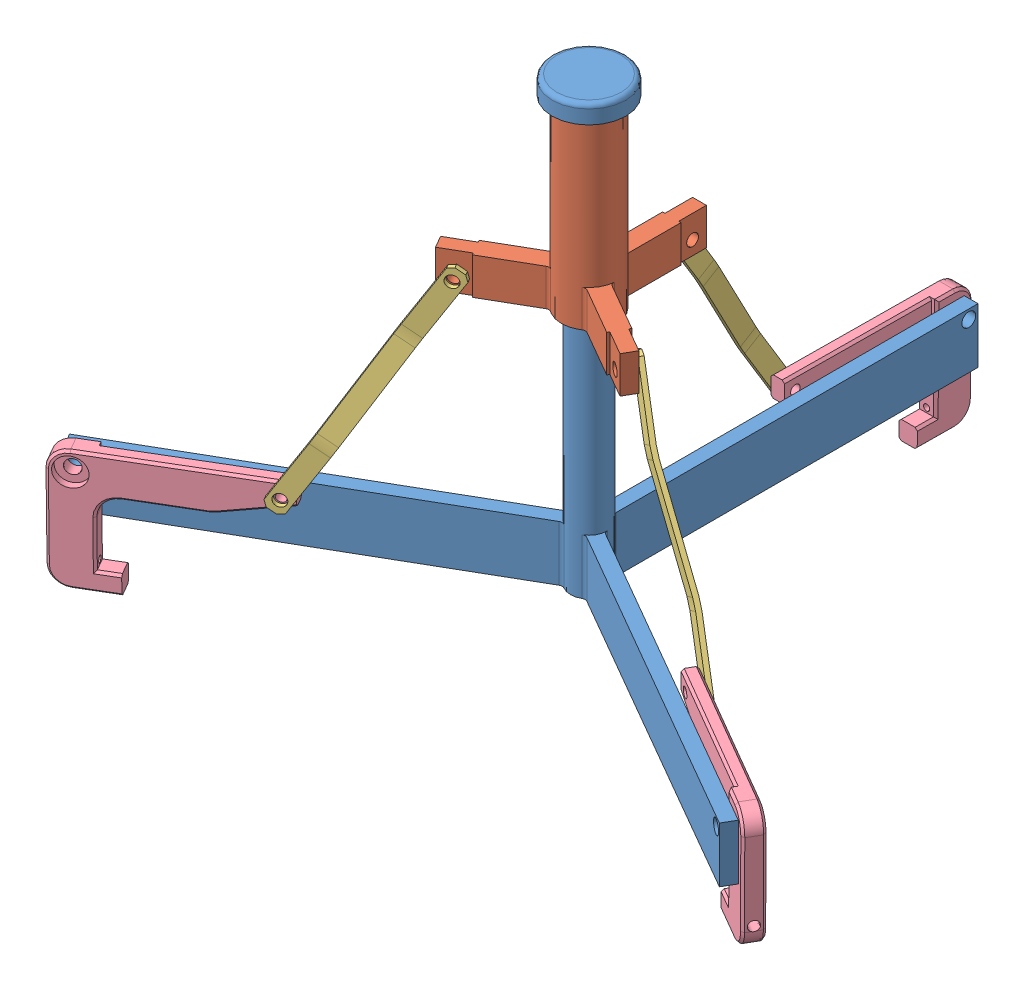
SolidWorks assembly plunger_hook.sldasm, configuration Default (file format 8000). Lengths in mm.
Overall size (473.99 343.02 420.11).
8 component instances, 4 part files, 20 mates.
Components (placement in the parent):
- center-1: center.sldprt [Default] x (-1 0 0) z (0 1 0) size (461.2 399.41 304.8)
- collar-1: collar.sldprt [Default] at (0 165.1 0) x (0.5 0 -0.866025) z (0 1 0) size (136.74 118.42 127)
- con-rod-1: con-rod.sldprt [Default] at (-128.4028 32.9021 97.9635) x (0.449568 0.854704 -0.259558) z (-0.5 0 -0.866025) size (177.8 12.7 14.61)
- con-rod-2: con-rod.sldprt [Default] at (149.0403 32.9021 62.2183) x (-0.449568 0.854704 -0.259558) z (-0.5 0 0.866025) size (177.8 12.7 14.61)
- con-rod-3: con-rod.sldprt [Default] at (-20.6375 32.9021 -160.1818) x (0 0.854704 0.519116) z (1 0 0) size (177.8 12.7 14.61)
- hook-1: hook.sldprt [Default] at (-213.9888 31.75 143.7105) x (-0.865988 -0.009307 0.499978) z (-0.5 0 -0.866025) size (127 82.55 12.7)
- hook-2: hook.sldprt [Default] at (231.4513 31.75 113.4645) x (0.865988 -0.009307 0.499978) z (-0.5 0 0.866025) size (127 82.55 12.7)
- hook-3: hook.sldprt [Default] at (-17.4625 31.75 -257.175) x (0 -0.009307 -0.999957) z (1 0 0) size (127 82.55 12.7)
Mates (geometry in assembly coordinates):
- Coincident1: coincident anti-aligned: plane of center-1 through (0 0 0) normal (0 -1 0); plane of assembly through (0 0 0) normal (0 1 0)
- Coincident2: coincident aligned: plane of center-1; plane of assembly through (0 0 0) normal (0 0 1)
- Coincident3: coincident anti-aligned: plane of center-1; plane of assembly through (0 0 0) normal (1 0 0)
- Concentric1: concentric aligned: cylinder of center-1 through (0 304.8 0) axis (0 -1 0) radius 12.7; cylinder of collar-1 through (0 292.1 0) axis (0 -1 0) radius 12.827
- Concentric2: concentric aligned: cylinder of center-1 through (-106.2292 31.75 330.3557) axis (-0.5 0 -0.866025) radius 4.7625; cylinder of hook-1 through (-213.9888 31.75 143.7105) axis (-0.5 0 -0.866025) radius 4.7625
- Coincident4: coincident anti-aligned: plane of center-1 through (-225.8381 0 135.8869) normal (0.5 0 0.866025); plane of hook-1 through (-231.2345 18.9323 139.0026) normal (-0.5 0 -0.866025)
- Concentric3: concentric aligned: cylinder of con-rod-1 through (-120.0485 36.5527 93.1401) axis (-0.5 0 -0.866025) radius 4.064; cylinder of hook-1 through (-121.636 36.5527 90.3905) axis (-0.5 0 -0.866025) radius 3.302
- Coincident5: coincident anti-aligned: plane of con-rod-1 through (-158.1917 52.6804 111.496) normal (-0.5 0 -0.866025); plane of hook-1 through (-224.8845 18.9323 150.0011) normal (0.5 0 0.866025)
- Concentric4: concentric aligned: cylinder of collar-1 through (-93.1191 174.625 -27.9369) axis (0.5 0 0.866025) radius 4.064; cylinder of con-rod-1 through (-54.726 174.625 38.5618) axis (0.5 0 0.866025) radius 4.064
- Concentric5: concentric aligned: cylinder of hook-2 through (139.0985 36.5527 60.1446) axis (-0.5 0 0.866025) radius 3.302; cylinder of con-rod-2 through (140.686 36.5527 57.3949) axis (-0.5 0 0.866025) radius 4.064
- Coincident6: coincident anti-aligned: plane of hook-2 through (242.347 18.9323 119.7552) normal (0.5 0 -0.866025); plane of con-rod-2 through (175.6542 52.6804 81.2501) normal (-0.5 0 0.866025)
- Concentric6: concentric anti-aligned: cylinder of center-1 through (106.2292 31.75 330.3557) axis (0.5 0 -0.866025) radius 4.7625; cylinder of hook-2 through (231.4513 31.75 113.4645) axis (-0.5 0 0.866025) radius 4.7625
- Coincident7: coincident anti-aligned: plane of center-1 through (230.6006 0 127.6381) normal (0.5 0 -0.866025); plane of hook-2 through (235.997 18.9323 130.7537) normal (-0.5 0 0.866025)
- Concentric7: concentric anti-aligned: cylinder of collar-1 through (67.2672 174.625 16.8397) axis (-0.5 0 0.866025) radius 4.064; cylinder of con-rod-2 through (60.7585 174.625 28.1132) axis (0.5 0 -0.866025) radius 4.064
- Concentric8: concentric aligned: cylinder of hook-3 through (-17.4625 36.5527 -150.5351) axis (1 0 0) radius 3.302; cylinder of con-rod-3 through (-20.6375 36.5527 -150.5351) axis (1 0 0) radius 4.064
- Coincident8: coincident anti-aligned: plane of hook-3 through (-17.4625 18.9323 -269.7562) normal (-1 0 0); plane of con-rod-3 through (-17.4625 52.6804 -192.746) normal (1 0 0)
- Concentric9: concentric aligned: cylinder of center-1 through (-12.7 31.75 -257.175) axis (1 0 0) radius 4.7625; cylinder of hook-3 through (-17.4625 31.75 -257.175) axis (1 0 0) radius 4.7625
- Coincident9: coincident anti-aligned: plane of center-1 through (-4.7625 0 -263.525) normal (-1 0 0); plane of hook-3 through (-4.7625 18.9323 -269.7562) normal (1 0 0)
- Concentric10: concentric anti-aligned: cylinder of collar-1 through (-70.7536 174.625 -66.675) axis (1 0 0) radius 4.064; cylinder of con-rod-3 through (-6.0325 174.625 -66.675) axis (-1 0 0) radius 4.064
- Distance1: distance anti-aligned: plane of center-1 through (0 292.1 0) normal (0 -1 0); plane of collar-1 through (0 292.1 0) normal (0 1 0)
